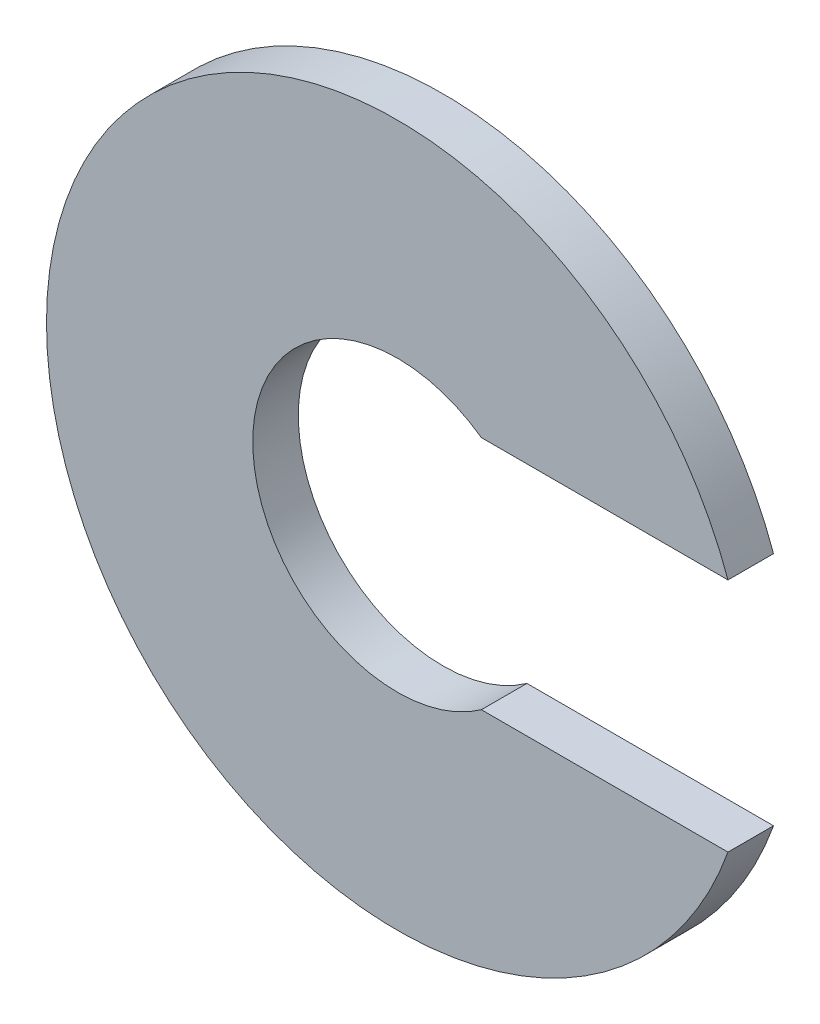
from build123d import *

# Parameters (mm, degrees)
BASE_EXTRUDE_DEPTH = 0.74


with BuildPart() as part:
    # Sketch1 → Base-Extrude (new body)
    with BuildSketch(Plane.XY):
        with BuildLine():
            Line((1.36381817, 1.913765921), (5.369124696, 1.913765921))
            ThreePointArc((5.369124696, 1.913765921), (-5.7, 0), (5.369124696, -1.913765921))
            Line((5.369124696, -1.913765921), (1.36381817, -1.913765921))
            ThreePointArc((1.36381817, -1.913765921), (-2.35, 0), (1.36381817, 1.913765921))
        make_face()
    extrude(amount=BASE_EXTRUDE_DEPTH)


solid = part.part
